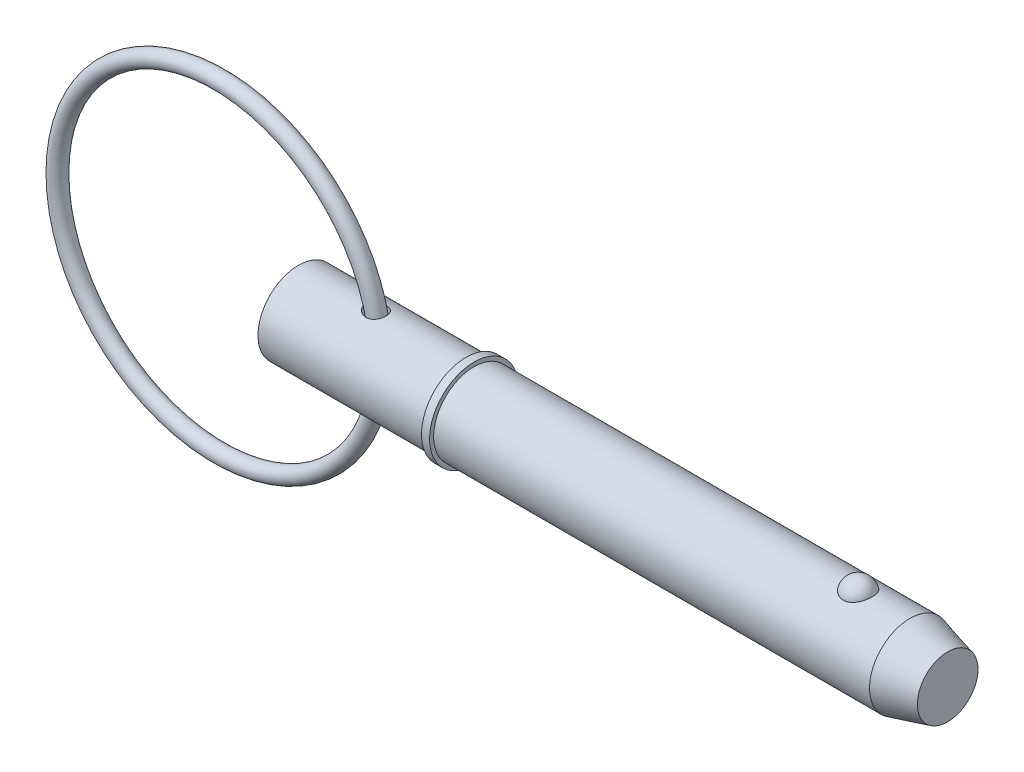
ISO-10303-21;
HEADER;
FILE_DESCRIPTION(('STEP AP214'),'2;1');
FILE_NAME('part.step','',(''),(''),'','','');
FILE_SCHEMA(('AUTOMOTIVE_DESIGN { 1 0 10303 214 1 1 1 1 }'));
ENDSEC;
DATA;
#1=APPLICATION_CONTEXT('core data for automotive mechanical design processes');
#2=APPLICATION_PROTOCOL_DEFINITION('international standard','automotive_design',2000,#1);
#3=PRODUCT_CONTEXT('',#1,'mechanical');
#4=PRODUCT('Part','Part','',(#3));
#5=PRODUCT_RELATED_PRODUCT_CATEGORY('part','',(#4));
#6=PRODUCT_DEFINITION_FORMATION('','',#4);
#7=PRODUCT_DEFINITION_CONTEXT('part definition',#1,'design');
#8=PRODUCT_DEFINITION('design','',#6,#7);
#9=PRODUCT_DEFINITION_SHAPE('','',#8);
#10=(LENGTH_UNIT() NAMED_UNIT(*) SI_UNIT(.MILLI.,.METRE.));
#11=(NAMED_UNIT(*) PLANE_ANGLE_UNIT() SI_UNIT($,.RADIAN.));
#12=(NAMED_UNIT(*) SI_UNIT($,.STERADIAN.) SOLID_ANGLE_UNIT());
#13=UNCERTAINTY_MEASURE_WITH_UNIT(LENGTH_MEASURE(1.E-05),#10,'distance_accuracy_value','');
#14=(GEOMETRIC_REPRESENTATION_CONTEXT(3) GLOBAL_UNCERTAINTY_ASSIGNED_CONTEXT((#13)) GLOBAL_UNIT_ASSIGNED_CONTEXT((#10,
#11,#12)) REPRESENTATION_CONTEXT('',''));
#15=CARTESIAN_POINT('',(0.,0.,0.));
#16=DIRECTION('',(0.,0.,1.));
#17=DIRECTION('',(1.,0.,0.));
#18=AXIS2_PLACEMENT_3D('',#15,#16,#17);
#19=CARTESIAN_POINT('',(-10.8860601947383,0.,0.));
#20=DIRECTION('',(0.,0.,1.));
#21=DIRECTION('',(1.,0.,0.));
#22=AXIS2_PLACEMENT_3D('',#19,#20,#21);
#23=TOROIDAL_SURFACE('',#22,22.225,1.111);
#24=CARTESIAN_POINT('',(12.4499398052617,0.,0.));
#25=VERTEX_POINT('',#24);
#26=VERTEX_LOOP('',#25);
#27=FACE_BOUND('',#26,.T.);
#28=ADVANCED_FACE('P0_F12',(#27),#23,.T.);
#29=CLOSED_SHELL('',(#28));
#30=MANIFOLD_SOLID_BREP('P0_B1',#29);
#31=CARTESIAN_POINT('',(0.,0.,0.));
#32=DIRECTION('',(1.,0.,0.));
#33=DIRECTION('',(0.,0.,-1.));
#34=AXIS2_PLACEMENT_3D('',#31,#32,#33);
#35=CYLINDRICAL_SURFACE('',#34,5.555);
#36=CARTESIAN_POINT('',(9.73108588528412,5.4531967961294,-1.05861687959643));
#37=CARTESIAN_POINT('',(9.79852417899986,5.4428857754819,-1.11173367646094));
#38=CARTESIAN_POINT('',(9.8705426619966,5.43287373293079,-1.15917228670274));
#39=CARTESIAN_POINT('',(10.0216706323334,5.41463354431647,-1.24159548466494));
#40=CARTESIAN_POINT('',(10.100788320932,5.40640749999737,-1.27656543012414));
#41=CARTESIAN_POINT('',(10.2640671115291,5.39277501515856,-1.33298568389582));
#42=CARTESIAN_POINT('',(10.3482338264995,5.38737178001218,-1.35442062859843));
#43=CARTESIAN_POINT('',(10.5191189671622,5.38018930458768,-1.38268153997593));
#44=CARTESIAN_POINT('',(10.6058357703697,5.37840780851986,-1.38951660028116));
#45=CARTESIAN_POINT('',(10.7759121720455,5.37883071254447,-1.38787777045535));
#46=CARTESIAN_POINT('',(10.8592768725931,5.38088957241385,-1.37996287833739));
#47=CARTESIAN_POINT('',(11.0231742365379,5.38856355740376,-1.34968531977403));
#48=CARTESIAN_POINT('',(11.1037078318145,5.39417750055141,-1.3273274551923));
#49=CARTESIAN_POINT('',(11.2542656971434,5.40784427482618,-1.27044672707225));
#50=CARTESIAN_POINT('',(11.3246325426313,5.41571997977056,-1.23678468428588));
#51=CARTESIAN_POINT('',(11.4584043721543,5.43310849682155,-1.15800564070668));
#52=CARTESIAN_POINT('',(11.5218100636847,5.4426211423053,-1.11288980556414));
#53=CARTESIAN_POINT('',(11.6387006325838,5.4619946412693,-1.01348173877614));
#54=CARTESIAN_POINT('',(11.6923567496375,5.47184490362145,-0.959388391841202));
#55=CARTESIAN_POINT('',(11.7899079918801,5.49098914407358,-0.842935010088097));
#56=CARTESIAN_POINT('',(11.8338027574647,5.50028310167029,-0.780574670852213));
#57=CARTESIAN_POINT('',(11.9111930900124,5.51740919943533,-0.64860577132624));
#58=CARTESIAN_POINT('',(11.944571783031,5.52522454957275,-0.578926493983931));
#59=CARTESIAN_POINT('',(11.9994972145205,5.53842713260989,-0.434834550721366));
#60=CARTESIAN_POINT('',(12.0210434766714,5.54381426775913,-0.360421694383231));
#61=CARTESIAN_POINT('',(12.0519313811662,5.55161917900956,-0.208311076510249));
#62=CARTESIAN_POINT('',(12.0611710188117,5.55401212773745,-0.130591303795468));
#63=CARTESIAN_POINT('',(12.0668974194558,5.55548938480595,0.0253480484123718));
#64=CARTESIAN_POINT('',(12.0633840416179,5.55457365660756,0.10356763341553));
#65=CARTESIAN_POINT('',(12.0436796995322,5.54953010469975,0.258343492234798));
#66=CARTESIAN_POINT('',(12.0274798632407,5.54540003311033,0.334898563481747));
#67=CARTESIAN_POINT('',(11.9827711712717,5.53437033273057,0.48411831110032));
#68=CARTESIAN_POINT('',(11.9542620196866,5.52747063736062,0.556782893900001));
#69=CARTESIAN_POINT('',(11.8856108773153,5.51165296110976,0.696153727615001));
#70=CARTESIAN_POINT('',(11.8454690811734,5.50273501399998,0.762860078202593));
#71=CARTESIAN_POINT('',(11.7545317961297,5.48386724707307,0.888403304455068));
#72=CARTESIAN_POINT('',(11.7037367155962,5.47391746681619,0.947240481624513));
#73=CARTESIAN_POINT('',(11.5931044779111,5.45416351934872,1.05504470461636));
#74=CARTESIAN_POINT('',(11.533318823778,5.44435885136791,1.10406448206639));
#75=CARTESIAN_POINT('',(11.4061321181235,5.42595363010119,1.19123649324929));
#76=CARTESIAN_POINT('',(11.3387321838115,5.41735290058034,1.22939031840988));
#77=CARTESIAN_POINT('',(11.1991395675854,5.4024225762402,1.29341737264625));
#78=CARTESIAN_POINT('',(11.1270175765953,5.39606585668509,1.3194385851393));
#79=CARTESIAN_POINT('',(10.979323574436,5.38614405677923,1.35937634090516));
#80=CARTESIAN_POINT('',(10.9037515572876,5.38257898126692,1.37329286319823));
#81=CARTESIAN_POINT('',(10.7507722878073,5.37854282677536,1.38901730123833));
#82=CARTESIAN_POINT('',(10.6733560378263,5.37809300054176,1.39074204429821));
#83=CARTESIAN_POINT('',(10.5192388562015,5.38029043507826,1.38221411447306));
#84=CARTESIAN_POINT('',(10.4425381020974,5.38293844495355,1.37195854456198));
#85=CARTESIAN_POINT('',(10.2878936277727,5.39116673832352,1.33926960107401));
#86=CARTESIAN_POINT('',(10.2100819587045,5.3968880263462,1.31624874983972));
#87=CARTESIAN_POINT('',(10.0591420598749,5.41064666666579,1.25849276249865));
#88=CARTESIAN_POINT('',(9.98601576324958,5.41868496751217,1.22375282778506));
#89=CARTESIAN_POINT('',(9.84175565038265,5.43675805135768,1.14087469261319));
#90=CARTESIAN_POINT('',(9.77103801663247,5.44688674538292,1.09202994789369));
#91=CARTESIAN_POINT('',(9.6388828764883,5.46759592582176,0.983100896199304));
#92=CARTESIAN_POINT('',(9.57744762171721,5.47817652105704,0.92301387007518));
#93=CARTESIAN_POINT('',(9.46620446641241,5.49850106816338,0.79298413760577));
#94=CARTESIAN_POINT('',(9.4163677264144,5.5082470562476,0.723066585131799));
#95=CARTESIAN_POINT('',(9.33050546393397,5.52566389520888,0.57497392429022));
#96=CARTESIAN_POINT('',(9.2944672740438,5.53333664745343,0.49680647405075));
#97=CARTESIAN_POINT('',(9.2410988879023,5.54491199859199,0.342579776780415));
#98=CARTESIAN_POINT('',(9.22228936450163,5.54910883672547,0.267055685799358));
#99=CARTESIAN_POINT('',(9.19883437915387,5.55436306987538,0.113748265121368));
#100=CARTESIAN_POINT('',(9.19417820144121,5.55542284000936,0.0359666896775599));
#101=CARTESIAN_POINT('',(9.19905385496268,5.55432298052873,-0.111477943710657));
#102=CARTESIAN_POINT('',(9.20724428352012,5.55246769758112,-0.181191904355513));
#103=CARTESIAN_POINT('',(9.23493000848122,5.54630180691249,-0.318223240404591));
#104=CARTESIAN_POINT('',(9.25442702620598,5.54199082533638,-0.385540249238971));
#105=CARTESIAN_POINT('',(9.30387481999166,5.5313474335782,-0.516280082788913));
#106=CARTESIAN_POINT('',(9.33386163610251,5.52500806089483,-0.579688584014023));
#107=CARTESIAN_POINT('',(9.40305503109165,5.51092599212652,-0.701037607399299));
#108=CARTESIAN_POINT('',(9.44225922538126,5.50318365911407,-0.758979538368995));
#109=CARTESIAN_POINT('',(9.52133732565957,5.48833949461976,-0.859230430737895));
#110=CARTESIAN_POINT('',(9.55998996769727,5.48134889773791,-0.90252975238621));
#111=CARTESIAN_POINT('',(9.64209346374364,5.46725903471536,-0.984288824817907));
#112=CARTESIAN_POINT('',(9.68554534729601,5.46015974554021,-1.02274753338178));
#113=CARTESIAN_POINT('',(9.73108588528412,5.4531967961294,-1.05861687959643));
#114=B_SPLINE_CURVE_WITH_KNOTS('',3,(#36,#37,#38,#39,#40,#41,#42,#43,#44,#45,#46,#47,#48,#49,
#50,#51,#52,#53,#54,#55,#56,#57,#58,#59,#60,#61,#62,#63,#64,#65,#66,#67,#68,#69,#70,#71,#72,#73,
#74,#75,#76,#77,#78,#79,#80,#81,#82,#83,#84,#85,#86,#87,#88,#89,#90,#91,#92,#93,#94,#95,#96,#97,
#98,#99,#100,#101,#102,#103,#104,#105,#106,#107,#108,#109,#110,#111,#112,#113),.UNSPECIFIED.,
.T.,.F.,(4,2,2,2,2,2,2,2,2,2,2,2,2,2,2,2,2,2,2,2,2,2,2,2,2,2,2,2,2,2,2,2,2,2,2,2,2,2,4),(0.,
0.259176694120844,0.518656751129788,0.778430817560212,1.03804303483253,1.28801585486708,
1.53790560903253,1.77195750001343,2.00598558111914,2.23539047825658,2.46480382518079,
2.69668356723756,2.9285726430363,3.16237203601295,3.39617401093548,3.63013963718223,
3.86411088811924,4.09807822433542,4.33203659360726,4.56470246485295,4.7973342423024,
5.02704913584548,5.25676442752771,5.48804534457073,5.71938220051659,5.96237360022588,
6.20546461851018,6.46387943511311,6.72235683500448,6.98018450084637,7.23777490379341,
7.47029684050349,7.70264268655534,7.91229396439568,8.12197716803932,8.33238797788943,
8.54274441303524,8.71772674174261,8.89274668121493),.UNSPECIFIED.);
#115=CARTESIAN_POINT('',(9.73108588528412,5.4531967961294,-1.05861687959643));
#116=VERTEX_POINT('',#115);
#117=EDGE_CURVE('P1_E42',#116,#116,#114,.T.);
#118=ORIENTED_EDGE('',*,*,#117,.T.);
#119=EDGE_LOOP('',(#118));
#120=FACE_BOUND('',#119,.T.);
#121=CARTESIAN_POINT('',(0.,0.,0.));
#122=DIRECTION('',(1.,0.,0.));
#123=DIRECTION('',(0.,0.,-1.));
#124=AXIS2_PLACEMENT_3D('',#121,#122,#123);
#125=CIRCLE('',#124,5.555);
#126=CARTESIAN_POINT('',(0.,0.,-5.555));
#127=VERTEX_POINT('',#126);
#128=EDGE_CURVE('P1_E9',#127,#127,#125,.T.);
#129=ORIENTED_EDGE('',*,*,#128,.T.);
#130=EDGE_LOOP('',(#129));
#131=FACE_BOUND('',#130,.T.);
#132=CARTESIAN_POINT('',(23.019,0.,0.));
#133=DIRECTION('',(1.,0.,0.));
#134=DIRECTION('',(0.,0.,-1.));
#135=AXIS2_PLACEMENT_3D('',#132,#133,#134);
#136=CIRCLE('',#135,5.555);
#137=CARTESIAN_POINT('',(23.019,0.,-5.555));
#138=VERTEX_POINT('',#137);
#139=EDGE_CURVE('P1_E25',#138,#138,#136,.T.);
#140=ORIENTED_EDGE('',*,*,#139,.F.);
#141=EDGE_LOOP('',(#140));
#142=FACE_BOUND('',#141,.T.);
#143=CARTESIAN_POINT('',(9.73108588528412,-5.4531967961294,-1.05861687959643));
#144=CARTESIAN_POINT('',(9.66821110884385,-5.46281068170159,-1.00909184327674));
#145=CARTESIAN_POINT('',(9.60927221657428,-5.47269103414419,-0.954597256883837));
#146=CARTESIAN_POINT('',(9.50103698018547,-5.49196271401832,-0.836622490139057));
#147=CARTESIAN_POINT('',(9.45174193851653,-5.50135397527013,-0.77314109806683));
#148=CARTESIAN_POINT('',(9.36449982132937,-5.51864538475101,-0.638139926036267));
#149=CARTESIAN_POINT('',(9.32660692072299,-5.52653835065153,-0.566583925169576));
#150=CARTESIAN_POINT('',(9.26443740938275,-5.53978685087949,-0.417563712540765));
#151=CARTESIAN_POINT('',(9.24015003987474,-5.54514438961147,-0.34010422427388));
#152=CARTESIAN_POINT('',(9.20806696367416,-5.55228040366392,-0.18838925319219));
#153=CARTESIAN_POINT('',(9.19907227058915,-5.55431849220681,-0.114399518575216));
#154=CARTESIAN_POINT('',(9.19432225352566,-5.55539069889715,0.0340148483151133));
#155=CARTESIAN_POINT('',(9.19856204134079,-5.55442592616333,0.108439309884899));
#156=CARTESIAN_POINT('',(9.21926816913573,-5.54978420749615,0.250226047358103));
#157=CARTESIAN_POINT('',(9.2348766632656,-5.54629766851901,0.31772275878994));
#158=CARTESIAN_POINT('',(9.27656619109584,-5.53719805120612,0.449233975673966));
#159=CARTESIAN_POINT('',(9.3026486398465,-5.53158468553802,0.513248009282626));
#160=CARTESIAN_POINT('',(9.36540111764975,-5.51852259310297,0.63880901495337));
#161=CARTESIAN_POINT('',(9.40244578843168,-5.51101059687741,0.700161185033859));
#162=CARTESIAN_POINT('',(9.48531033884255,-5.49498546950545,0.816463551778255));
#163=CARTESIAN_POINT('',(9.5311337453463,-5.48647193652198,0.871411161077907));
#164=CARTESIAN_POINT('',(9.63549825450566,-5.46826315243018,0.979510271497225));
#165=CARTESIAN_POINT('',(9.69487291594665,-5.4585383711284,1.03185240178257));
#166=CARTESIAN_POINT('',(9.82107706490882,-5.43973797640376,1.12677509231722));
#167=CARTESIAN_POINT('',(9.8879103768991,-5.43066269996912,1.16935061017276));
#168=CARTESIAN_POINT('',(10.033391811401,-5.41336505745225,1.24708757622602));
#169=CARTESIAN_POINT('',(10.1125613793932,-5.40528106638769,1.28130933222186));
#170=CARTESIAN_POINT('',(10.2757060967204,-5.39196874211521,1.3362270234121));
#171=CARTESIAN_POINT('',(10.3596813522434,-5.38674047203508,1.35692265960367));
#172=CARTESIAN_POINT('',(10.5297702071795,-5.37991196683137,1.38375156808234));
#173=CARTESIAN_POINT('',(10.6158742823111,-5.37829778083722,1.38994084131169));
#174=CARTESIAN_POINT('',(10.7878226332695,-5.3790107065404,1.38718250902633));
#175=CARTESIAN_POINT('',(10.8736670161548,-5.38133587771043,1.37824235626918));
#176=CARTESIAN_POINT('',(11.0366214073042,-5.38945418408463,1.34612618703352));
#177=CARTESIAN_POINT('',(11.1139351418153,-5.39501006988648,1.32392147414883));
#178=CARTESIAN_POINT('',(11.2633246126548,-5.40877222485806,1.26652021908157));
#179=CARTESIAN_POINT('',(11.3354015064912,-5.4169779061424,1.23132655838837));
#180=CARTESIAN_POINT('',(11.4690899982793,-5.43466078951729,1.15069817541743));
#181=CARTESIAN_POINT('',(11.5310200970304,-5.4440673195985,1.10577441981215));
#182=CARTESIAN_POINT('',(11.6463540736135,-5.46335537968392,1.0061512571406));
#183=CARTESIAN_POINT('',(11.6997580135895,-5.47323690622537,0.951451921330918));
#184=CARTESIAN_POINT('',(11.7967319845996,-5.49239864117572,0.833747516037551));
#185=CARTESIAN_POINT('',(11.8402908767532,-5.50167816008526,0.770733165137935));
#186=CARTESIAN_POINT('',(11.9164538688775,-5.518621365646,0.638202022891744));
#187=CARTESIAN_POINT('',(11.9490573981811,-5.52628496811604,0.568684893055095));
#188=CARTESIAN_POINT('',(12.0028717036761,-5.53925911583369,0.424207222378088));
#189=CARTESIAN_POINT('',(12.023941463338,-5.54454040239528,0.349191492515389));
#190=CARTESIAN_POINT('',(12.053591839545,-5.55204602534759,0.196582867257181));
#191=CARTESIAN_POINT('',(12.0621722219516,-5.55427030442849,0.118989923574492));
#192=CARTESIAN_POINT('',(12.0666512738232,-5.55542602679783,-0.0368468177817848));
#193=CARTESIAN_POINT('',(12.0625074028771,-5.55434642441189,-0.115091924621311));
#194=CARTESIAN_POINT('',(12.0415418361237,-5.54898613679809,-0.269753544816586));
#195=CARTESIAN_POINT('',(12.0247199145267,-5.54470539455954,-0.346170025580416));
#196=CARTESIAN_POINT('',(11.9787920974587,-5.53340452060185,-0.495008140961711));
#197=CARTESIAN_POINT('',(11.9496857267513,-5.52638428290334,-0.56742962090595));
#198=CARTESIAN_POINT('',(11.8798787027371,-5.51036911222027,-0.706216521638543));
#199=CARTESIAN_POINT('',(11.8391779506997,-5.50137416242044,-0.772581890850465));
#200=CARTESIAN_POINT('',(11.7472553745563,-5.48242167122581,-0.89724716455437));
#201=CARTESIAN_POINT('',(11.6960515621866,-5.47246579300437,-0.955560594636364));
#202=CARTESIAN_POINT('',(11.5843994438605,-5.45270071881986,-1.06256643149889));
#203=CARTESIAN_POINT('',(11.5239521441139,-5.44289150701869,-1.11125988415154));
#204=CARTESIAN_POINT('',(11.396157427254,-5.42463941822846,-1.19717500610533));
#205=CARTESIAN_POINT('',(11.3288903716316,-5.41618309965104,-1.23451335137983));
#206=CARTESIAN_POINT('',(11.1888557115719,-5.40145691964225,-1.29743539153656));
#207=CARTESIAN_POINT('',(11.1160887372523,-5.39518680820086,-1.32302043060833));
#208=CARTESIAN_POINT('',(10.9677009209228,-5.38553131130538,-1.36179181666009));
#209=CARTESIAN_POINT('',(10.8921036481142,-5.3821260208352,-1.3750637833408));
#210=CARTESIAN_POINT('',(10.7396925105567,-5.37842027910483,-1.38948741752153));
#211=CARTESIAN_POINT('',(10.6628784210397,-5.37812040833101,-1.39063681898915));
#212=CARTESIAN_POINT('',(10.5077947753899,-5.38059635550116,-1.38102577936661));
#213=CARTESIAN_POINT('',(10.4295489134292,-5.3834629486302,-1.36991384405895));
#214=CARTESIAN_POINT('',(10.2758428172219,-5.3920092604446,-1.33587599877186));
#215=CARTESIAN_POINT('',(10.2003829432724,-5.39768934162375,-1.3129485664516));
#216=CARTESIAN_POINT('',(10.0559381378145,-5.41102817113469,-1.25682313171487));
#217=CARTESIAN_POINT('',(9.98683368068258,-5.41862962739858,-1.22391777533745));
#218=CARTESIAN_POINT('',(9.85432617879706,-5.43513913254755,-1.14838146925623));
#219=CARTESIAN_POINT('',(9.79092361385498,-5.44404729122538,-1.1057497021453));
#220=CARTESIAN_POINT('',(9.73108588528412,-5.4531967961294,-1.05861687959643));
#221=B_SPLINE_CURVE_WITH_KNOTS('',3,(#143,#144,#145,#146,#147,#148,#149,#150,#151,#152,#153,
#154,#155,#156,#157,#158,#159,#160,#161,#162,#163,#164,#165,#166,#167,#168,#169,#170,#171,#172,
#173,#174,#175,#176,#177,#178,#179,#180,#181,#182,#183,#184,#185,#186,#187,#188,#189,#190,#191,
#192,#193,#194,#195,#196,#197,#198,#199,#200,#201,#202,#203,#204,#205,#206,#207,#208,#209,#210,
#211,#212,#213,#214,#215,#216,#217,#218,#219,#220),.UNSPECIFIED.,.T.,.F.,(4,2,2,2,2,2,2,2,2,2,2,
2,2,2,2,2,2,2,2,2,2,2,2,2,2,2,2,2,2,2,2,2,2,2,2,2,2,2,4),(0.,0.241596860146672,
0.483226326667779,0.725986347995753,0.968554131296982,1.19103755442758,1.41343881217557,
1.62059806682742,1.82778531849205,2.04308674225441,2.25847484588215,2.4967195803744,
2.73508704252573,2.99374644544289,3.25241156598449,3.51007646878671,3.76761448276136,
4.00827541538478,4.24888299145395,4.47904430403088,4.70920393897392,4.93962269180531,
5.17005344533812,5.4032419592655,5.63643484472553,5.87040820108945,6.10438572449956,
6.33837230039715,6.57236086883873,6.80595147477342,7.03951667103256,7.27059385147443,
7.50164459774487,7.73107640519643,7.96055109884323,8.19677907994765,8.43303750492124,
8.66294515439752,8.8928721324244),.UNSPECIFIED.);
#222=CARTESIAN_POINT('',(9.73108588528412,-5.4531967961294,-1.05861687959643));
#223=VERTEX_POINT('',#222);
#224=EDGE_CURVE('P1_E17',#223,#223,#221,.T.);
#225=ORIENTED_EDGE('',*,*,#224,.T.);
#226=EDGE_LOOP('',(#225));
#227=FACE_BOUND('',#226,.T.);
#228=ADVANCED_FACE('P1_F13',(#120,#131,#142,#227),#35,.T.);
#229=CARTESIAN_POINT('',(0.,0.,0.));
#230=DIRECTION('',(1.,0.,0.));
#231=DIRECTION('',(0.,0.,-1.));
#232=AXIS2_PLACEMENT_3D('',#229,#230,#231);
#233=CYLINDRICAL_SURFACE('',#232,5.555);
#234=CARTESIAN_POINT('',(84.0171144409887,0.,0.));
#235=DIRECTION('',(1.,0.,0.));
#236=DIRECTION('',(0.,0.,-1.));
#237=AXIS2_PLACEMENT_3D('',#234,#235,#236);
#238=CIRCLE('',#237,5.555);
#239=CARTESIAN_POINT('',(84.0171144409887,0.,-5.555));
#240=VERTEX_POINT('',#239);
#241=EDGE_CURVE('P1_E99',#240,#240,#238,.T.);
#242=ORIENTED_EDGE('',*,*,#241,.F.);
#243=EDGE_LOOP('',(#242));
#244=FACE_BOUND('',#243,.T.);
#245=CARTESIAN_POINT('',(24.13,0.,0.));
#246=DIRECTION('',(1.,0.,0.));
#247=DIRECTION('',(0.,0.,-1.));
#248=AXIS2_PLACEMENT_3D('',#245,#246,#247);
#249=CIRCLE('',#248,5.555);
#250=CARTESIAN_POINT('',(24.13,0.,-5.555));
#251=VERTEX_POINT('',#250);
#252=EDGE_CURVE('P1_E96',#251,#251,#249,.T.);
#253=ORIENTED_EDGE('',*,*,#252,.T.);
#254=EDGE_LOOP('',(#253));
#255=FACE_BOUND('',#254,.T.);
#256=CARTESIAN_POINT('',(76.8986264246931,5.16741224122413,2.03859650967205));
#257=CARTESIAN_POINT('',(76.7929492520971,5.16740893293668,2.03859990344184));
#258=CARTESIAN_POINT('',(76.6872989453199,5.17079470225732,2.03008306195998));
#259=CARTESIAN_POINT('',(76.4791419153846,5.18392795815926,1.9963072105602));
#260=CARTESIAN_POINT('',(76.3766344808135,5.19367399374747,1.9710520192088));
#261=CARTESIAN_POINT('',(76.1777710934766,5.21839168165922,1.90463997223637));
#262=CARTESIAN_POINT('',(76.0814064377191,5.23335573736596,1.86350622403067));
#263=CARTESIAN_POINT('',(75.8970804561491,5.26688076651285,1.76652592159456));
#264=CARTESIAN_POINT('',(75.8091207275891,5.28544242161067,1.71067657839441));
#265=CARTESIAN_POINT('',(75.641265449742,5.32479845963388,1.58399959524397));
#266=CARTESIAN_POINT('',(75.5616656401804,5.34564089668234,1.51279545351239));
#267=CARTESIAN_POINT('',(75.4151290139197,5.38697258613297,1.35828584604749));
#268=CARTESIAN_POINT('',(75.348194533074,5.40746177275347,1.27497815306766));
#269=CARTESIAN_POINT('',(75.2256103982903,5.44694508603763,1.09440293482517));
#270=CARTESIAN_POINT('',(75.170598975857,5.46583143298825,0.996677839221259));
#271=CARTESIAN_POINT('',(75.0769376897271,5.49908030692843,0.792961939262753));
#272=CARTESIAN_POINT('',(75.0382894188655,5.513442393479,0.686970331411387));
#273=CARTESIAN_POINT('',(74.9776807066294,5.536358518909,0.468019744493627));
#274=CARTESIAN_POINT('',(74.9559725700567,5.54482455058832,0.35498154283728));
#275=CARTESIAN_POINT('',(74.9306362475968,5.55473324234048,0.126595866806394));
#276=CARTESIAN_POINT('',(74.9270077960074,5.55617600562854,0.0112484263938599));
#277=CARTESIAN_POINT('',(74.9378817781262,5.55189984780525,-0.218011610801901));
#278=CARTESIAN_POINT('',(74.9523151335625,5.54620821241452,-0.331928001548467));
#279=CARTESIAN_POINT('',(74.998903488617,5.52828920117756,-0.555544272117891));
#280=CARTESIAN_POINT('',(75.0310588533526,5.5160616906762,-0.665244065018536));
#281=CARTESIAN_POINT('',(75.1124883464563,5.48630779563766,-0.877469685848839));
#282=CARTESIAN_POINT('',(75.1617816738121,5.4687754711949,-0.979987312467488));
#283=CARTESIAN_POINT('',(75.2764785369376,5.43024700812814,-1.17486975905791));
#284=CARTESIAN_POINT('',(75.3418831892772,5.4092506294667,-1.26723387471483));
#285=CARTESIAN_POINT('',(75.4875712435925,5.36600927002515,-1.43940133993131));
#286=CARTESIAN_POINT('',(75.5678859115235,5.34376173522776,-1.51917763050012));
#287=CARTESIAN_POINT('',(75.7414520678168,5.30057971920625,-1.66360338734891));
#288=CARTESIAN_POINT('',(75.834702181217,5.27964509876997,-1.72825445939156));
#289=CARTESIAN_POINT('',(76.0293939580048,5.24205250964,-1.83909478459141));
#290=CARTESIAN_POINT('',(76.1305900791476,5.22530519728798,-1.88568407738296));
#291=CARTESIAN_POINT('',(76.3401552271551,5.19750919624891,-1.96100802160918));
#292=CARTESIAN_POINT('',(76.4485215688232,5.1864583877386,-1.98974931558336));
#293=CARTESIAN_POINT('',(76.6634989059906,5.17184410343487,-2.02742262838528));
#294=CARTESIAN_POINT('',(76.769925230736,5.16793282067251,-2.0372760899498));
#295=CARTESIAN_POINT('',(76.9829925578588,5.1669899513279,-2.03966777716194));
#296=CARTESIAN_POINT('',(77.0896335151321,5.16995704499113,-2.03220932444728));
#297=CARTESIAN_POINT('',(77.2967730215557,5.18222383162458,-2.0007117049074));
#298=CARTESIAN_POINT('',(77.3973599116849,5.19133213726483,-1.97717337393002));
#299=CARTESIAN_POINT('',(77.5930141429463,5.21467637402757,-1.91475248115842));
#300=CARTESIAN_POINT('',(77.6880810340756,5.22891272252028,-1.87586867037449));
#301=CARTESIAN_POINT('',(77.872371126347,5.26137066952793,-1.78282713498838));
#302=CARTESIAN_POINT('',(77.9614190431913,5.27967329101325,-1.72835124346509));
#303=CARTESIAN_POINT('',(78.1292880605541,5.31817411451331,-1.60597483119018));
#304=CARTESIAN_POINT('',(78.2081068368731,5.33837274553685,-1.53807126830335));
#305=CARTESIAN_POINT('',(78.3575156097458,5.37968287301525,-1.38688970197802));
#306=CARTESIAN_POINT('',(78.4275058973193,5.40079011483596,-1.30301744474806));
#307=CARTESIAN_POINT('',(78.5530125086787,5.44074401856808,-1.1245817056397));
#308=CARTESIAN_POINT('',(78.6085262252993,5.4595902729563,-1.03001630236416));
#309=CARTESIAN_POINT('',(78.7055507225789,5.49369849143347,-0.82943923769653));
#310=CARTESIAN_POINT('',(78.7465483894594,5.5088242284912,-0.72315564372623));
#311=CARTESIAN_POINT('',(78.8111250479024,5.53310911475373,-0.504772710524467));
#312=CARTESIAN_POINT('',(78.8347036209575,5.54226812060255,-0.392673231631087));
#313=CARTESIAN_POINT('',(78.864013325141,5.55370358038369,-0.165459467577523));
#314=CARTESIAN_POINT('',(78.8696884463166,5.55595843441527,-0.050336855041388));
#315=CARTESIAN_POINT('',(78.862916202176,5.55329317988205,0.179288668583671));
#316=CARTESIAN_POINT('',(78.8504690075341,5.54837313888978,0.29379158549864));
#317=CARTESIAN_POINT('',(78.8077798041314,5.53189037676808,0.518526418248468));
#318=CARTESIAN_POINT('',(78.777598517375,5.5203503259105,0.628771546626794));
#319=CARTESIAN_POINT('',(78.7000962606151,5.49182453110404,0.842318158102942));
#320=CARTESIAN_POINT('',(78.6527743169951,5.47483847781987,0.945619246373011));
#321=CARTESIAN_POINT('',(78.5417204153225,5.43710633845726,1.14281571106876));
#322=CARTESIAN_POINT('',(78.4779215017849,5.41634501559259,1.23667048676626));
#323=CARTESIAN_POINT('',(78.3353577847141,5.37334572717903,1.41185243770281));
#324=CARTESIAN_POINT('',(78.2565932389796,5.35110778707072,1.49317982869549));
#325=CARTESIAN_POINT('',(78.0864234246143,5.30779474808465,1.64049162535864));
#326=CARTESIAN_POINT('',(77.9951002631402,5.28671324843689,1.7065687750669));
#327=CARTESIAN_POINT('',(77.8017390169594,5.24804852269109,1.82201372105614));
#328=CARTESIAN_POINT('',(77.6997005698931,5.23046541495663,1.87138095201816));
#329=CARTESIAN_POINT('',(77.4836187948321,5.20042692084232,1.95335298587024));
#330=CARTESIAN_POINT('',(77.369260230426,5.18820192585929,1.98521734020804));
#331=CARTESIAN_POINT('',(77.1361307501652,5.17169804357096,2.02783294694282));
#332=CARTESIAN_POINT('',(77.0173616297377,5.16741595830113,2.03859269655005));
#333=CARTESIAN_POINT('',(76.8986264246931,5.16741224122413,2.03859650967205));
#334=B_SPLINE_CURVE_WITH_KNOTS('',3,(#256,#257,#258,#259,#260,#261,#262,#263,#264,#265,#266,
#267,#268,#269,#270,#271,#272,#273,#274,#275,#276,#277,#278,#279,#280,#281,#282,#283,#284,#285,
#286,#287,#288,#289,#290,#291,#292,#293,#294,#295,#296,#297,#298,#299,#300,#301,#302,#303,#304,
#305,#306,#307,#308,#309,#310,#311,#312,#313,#314,#315,#316,#317,#318,#319,#320,#321,#322,#323,
#324,#325,#326,#327,#328,#329,#330,#331,#332,#333),.UNSPECIFIED.,.T.,.F.,(4,2,2,2,2,2,2,2,2,2,2,
2,2,2,2,2,2,2,2,2,2,2,2,2,2,2,2,2,2,2,2,2,2,2,2,2,2,2,4),(0.,0.316595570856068,
0.633118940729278,0.949183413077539,1.26530783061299,1.59030762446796,1.9153672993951,
2.25495824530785,2.59458224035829,2.93917283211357,3.28375835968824,3.62703002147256,
3.97030875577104,4.31397329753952,4.65766166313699,5.00207904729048,5.34645984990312,
5.68270547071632,6.01882587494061,6.33808403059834,6.65728093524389,6.96696376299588,
7.27667180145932,7.59321535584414,7.90983070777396,8.24210387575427,8.57443684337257,
8.91755896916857,9.26068933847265,9.60489211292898,9.94909164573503,10.2921194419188,
10.6351667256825,10.9796305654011,11.3240884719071,11.6663928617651,12.0087088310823,
12.3645679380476,12.7202837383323),.UNSPECIFIED.);
#335=CARTESIAN_POINT('',(76.8986264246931,5.16741224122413,2.03859650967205));
#336=VERTEX_POINT('',#335);
#337=EDGE_CURVE('P1_E34',#336,#336,#334,.T.);
#338=ORIENTED_EDGE('',*,*,#337,.T.);
#339=EDGE_LOOP('',(#338));
#340=FACE_BOUND('',#339,.T.);
#341=ADVANCED_FACE('P1_F46',(#244,#255,#340),#233,.T.);
#342=CARTESIAN_POINT('',(0.,0.,0.));
#343=DIRECTION('',(-1.,0.,0.));
#344=DIRECTION('',(0.,0.,1.));
#345=AXIS2_PLACEMENT_3D('',#342,#343,#344);
#346=PLANE('',#345);
#347=ORIENTED_EDGE('',*,*,#128,.F.);
#348=EDGE_LOOP('',(#347));
#349=FACE_BOUND('',#348,.T.);
#350=ADVANCED_FACE('P1_F15',(#349),#346,.T.);
#351=CARTESIAN_POINT('',(23.019,5.555,0.));
#352=DIRECTION('',(-1.,0.,0.));
#353=DIRECTION('',(0.,0.,1.));
#354=AXIS2_PLACEMENT_3D('',#351,#352,#353);
#355=PLANE('',#354);
#356=ORIENTED_EDGE('',*,*,#139,.T.);
#357=EDGE_LOOP('',(#356));
#358=FACE_BOUND('',#357,.T.);
#359=CARTESIAN_POINT('',(23.019,0.,0.));
#360=DIRECTION('',(1.,0.,0.));
#361=DIRECTION('',(0.,0.,-1.));
#362=AXIS2_PLACEMENT_3D('',#359,#360,#361);
#363=CIRCLE('',#362,6.1105);
#364=CARTESIAN_POINT('',(23.019,0.,-6.1105));
#365=VERTEX_POINT('',#364);
#366=EDGE_CURVE('P1_E30',#365,#365,#363,.T.);
#367=ORIENTED_EDGE('',*,*,#366,.F.);
#368=EDGE_LOOP('',(#367));
#369=FACE_BOUND('',#368,.T.);
#370=ADVANCED_FACE('P1_F81',(#358,#369),#355,.T.);
#371=CARTESIAN_POINT('',(0.,0.,0.));
#372=DIRECTION('',(1.,0.,0.));
#373=DIRECTION('',(0.,0.,-1.));
#374=AXIS2_PLACEMENT_3D('',#371,#372,#373);
#375=CYLINDRICAL_SURFACE('',#374,6.1105);
#376=ORIENTED_EDGE('',*,*,#366,.T.);
#377=EDGE_LOOP('',(#376));
#378=FACE_BOUND('',#377,.T.);
#379=CARTESIAN_POINT('',(24.13,0.,0.));
#380=DIRECTION('',(1.,0.,0.));
#381=DIRECTION('',(0.,0.,-1.));
#382=AXIS2_PLACEMENT_3D('',#379,#380,#381);
#383=CIRCLE('',#382,6.1105);
#384=CARTESIAN_POINT('',(24.13,0.,-6.1105));
#385=VERTEX_POINT('',#384);
#386=EDGE_CURVE('P1_E95',#385,#385,#383,.T.);
#387=ORIENTED_EDGE('',*,*,#386,.F.);
#388=EDGE_LOOP('',(#387));
#389=FACE_BOUND('',#388,.T.);
#390=ADVANCED_FACE('P1_F68',(#378,#389),#375,.T.);
#391=CARTESIAN_POINT('',(24.13,6.1105,0.));
#392=DIRECTION('',(1.,0.,0.));
#393=DIRECTION('',(0.,0.,-1.));
#394=AXIS2_PLACEMENT_3D('',#391,#392,#393);
#395=PLANE('',#394);
#396=ORIENTED_EDGE('',*,*,#386,.T.);
#397=EDGE_LOOP('',(#396));
#398=FACE_BOUND('',#397,.T.);
#399=ORIENTED_EDGE('',*,*,#252,.F.);
#400=EDGE_LOOP('',(#399));
#401=FACE_BOUND('',#400,.T.);
#402=ADVANCED_FACE('P1_F62',(#398,#401),#395,.T.);
#403=CARTESIAN_POINT('',(89.2,0.,0.));
#404=DIRECTION('',(-1.,0.,0.));
#405=DIRECTION('',(0.,0.,1.));
#406=AXIS2_PLACEMENT_3D('',#403,#404,#405);
#407=CONICAL_SURFACE('',#406,4.16625000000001,0.26179938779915);
#408=ORIENTED_EDGE('',*,*,#241,.T.);
#409=EDGE_LOOP('',(#408));
#410=FACE_BOUND('',#409,.T.);
#411=CARTESIAN_POINT('',(89.2,0.,0.));
#412=DIRECTION('',(1.,0.,0.));
#413=DIRECTION('',(0.,0.,-1.));
#414=AXIS2_PLACEMENT_3D('',#411,#412,#413);
#415=CIRCLE('',#414,4.16625000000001);
#416=CARTESIAN_POINT('',(89.2,0.,-4.16625000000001));
#417=VERTEX_POINT('',#416);
#418=EDGE_CURVE('P1_E41',#417,#417,#415,.T.);
#419=ORIENTED_EDGE('',*,*,#418,.F.);
#420=EDGE_LOOP('',(#419));
#421=FACE_BOUND('',#420,.T.);
#422=ADVANCED_FACE('P1_F59',(#410,#421),#407,.T.);
#423=CARTESIAN_POINT('',(89.2,4.16625000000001,0.));
#424=DIRECTION('',(1.,0.,0.));
#425=DIRECTION('',(0.,0.,-1.));
#426=AXIS2_PLACEMENT_3D('',#423,#424,#425);
#427=PLANE('',#426);
#428=ORIENTED_EDGE('',*,*,#418,.T.);
#429=EDGE_LOOP('',(#428));
#430=FACE_BOUND('',#429,.T.);
#431=ADVANCED_FACE('P1_F55',(#430),#427,.T.);
#432=CARTESIAN_POINT('',(76.8986264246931,4.9995,0.));
#433=DIRECTION('',(-1.,0.,0.));
#434=DIRECTION('',(0.,1.,0.));
#435=AXIS2_PLACEMENT_3D('',#432,#433,#434);
#436=SPHERICAL_SURFACE('',#435,2.04549999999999);
#437=ORIENTED_EDGE('',*,*,#337,.F.);
#438=EDGE_LOOP('',(#437));
#439=FACE_BOUND('',#438,.T.);
#440=ADVANCED_FACE('P1_F50',(#439),#436,.T.);
#441=CARTESIAN_POINT('',(-10.8860601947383,0.,0.));
#442=DIRECTION('',(0.,0.,1.));
#443=DIRECTION('',(1.,0.,0.));
#444=AXIS2_PLACEMENT_3D('',#441,#442,#443);
#445=TOROIDAL_SURFACE('',#444,22.225,1.38875);
#446=ORIENTED_EDGE('',*,*,#224,.F.);
#447=EDGE_LOOP('',(#446));
#448=FACE_BOUND('',#447,.T.);
#449=ORIENTED_EDGE('',*,*,#117,.F.);
#450=EDGE_LOOP('',(#449));
#451=FACE_BOUND('',#450,.T.);
#452=ADVANCED_FACE('P1_F54',(#448,#451),#445,.F.);
#453=CLOSED_SHELL('',(#228,#341,#350,#370,#390,#402,#422,#431,#440,#452));
#454=MANIFOLD_SOLID_BREP('P1_B1',#453);
#455=ADVANCED_BREP_SHAPE_REPRESENTATION('',(#18,#30,#454),#14);
#456=SHAPE_DEFINITION_REPRESENTATION(#9,#455);
ENDSEC;
END-ISO-10303-21;
